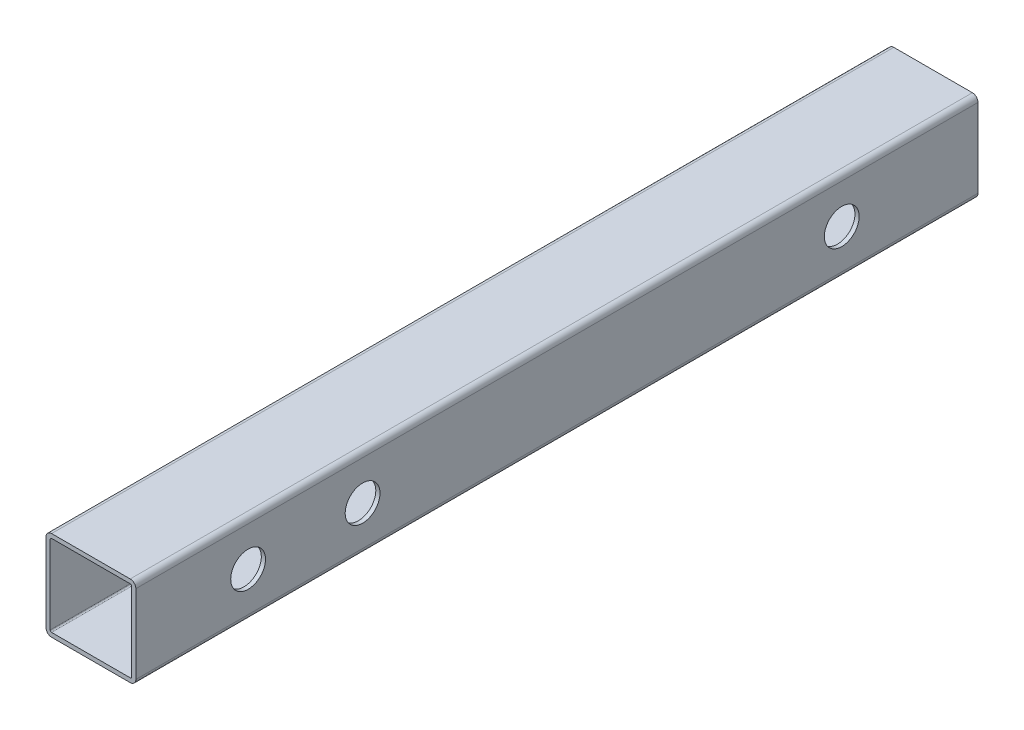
ISO-10303-21;
HEADER;
FILE_DESCRIPTION(('STEP AP214'),'2;1');
FILE_NAME('part.step','',(''),(''),'','','');
FILE_SCHEMA(('AUTOMOTIVE_DESIGN { 1 0 10303 214 1 1 1 1 }'));
ENDSEC;
DATA;
#1=APPLICATION_CONTEXT('core data for automotive mechanical design processes');
#2=APPLICATION_PROTOCOL_DEFINITION('international standard','automotive_design',2000,#1);
#3=PRODUCT_CONTEXT('',#1,'mechanical');
#4=PRODUCT('Part','Part','',(#3));
#5=PRODUCT_RELATED_PRODUCT_CATEGORY('part','',(#4));
#6=PRODUCT_DEFINITION_FORMATION('','',#4);
#7=PRODUCT_DEFINITION_CONTEXT('part definition',#1,'design');
#8=PRODUCT_DEFINITION('design','',#6,#7);
#9=PRODUCT_DEFINITION_SHAPE('','',#8);
#10=(LENGTH_UNIT() NAMED_UNIT(*) SI_UNIT(.MILLI.,.METRE.));
#11=(NAMED_UNIT(*) PLANE_ANGLE_UNIT() SI_UNIT($,.RADIAN.));
#12=(NAMED_UNIT(*) SI_UNIT($,.STERADIAN.) SOLID_ANGLE_UNIT());
#13=UNCERTAINTY_MEASURE_WITH_UNIT(LENGTH_MEASURE(1.E-05),#10,'distance_accuracy_value','');
#14=(GEOMETRIC_REPRESENTATION_CONTEXT(3) GLOBAL_UNCERTAINTY_ASSIGNED_CONTEXT((#13)) GLOBAL_UNIT_ASSIGNED_CONTEXT((#10,
#11,#12)) REPRESENTATION_CONTEXT('',''));
#15=CARTESIAN_POINT('',(0.,0.,0.));
#16=DIRECTION('',(0.,0.,1.));
#17=DIRECTION('',(1.,0.,0.));
#18=AXIS2_PLACEMENT_3D('',#15,#16,#17);
#19=CARTESIAN_POINT('',(-44.45,44.45,476.25));
#20=DIRECTION('',(0.,0.,-1.));
#21=DIRECTION('',(-1.,0.,0.));
#22=AXIS2_PLACEMENT_3D('',#19,#20,#21);
#23=PLANE('',#22);
#24=CARTESIAN_POINT('',(-44.45,44.45,476.25));
#25=DIRECTION('',(0.,0.,1.));
#26=DIRECTION('',(-1.,0.,0.));
#27=AXIS2_PLACEMENT_3D('',#24,#25,#26);
#28=CIRCLE('',#27,6.35);
#29=CARTESIAN_POINT('',(-44.45,50.8,476.25));
#30=VERTEX_POINT('',#29);
#31=CARTESIAN_POINT('',(-50.8,44.45,476.25));
#32=VERTEX_POINT('',#31);
#33=EDGE_CURVE('E227',#30,#32,#28,.T.);
#34=ORIENTED_EDGE('',*,*,#33,.T.);
#35=DIRECTION('',(0.,-1.,0.));
#36=VECTOR('',#35,1.);
#37=CARTESIAN_POINT('',(-50.8,44.45,476.25));
#38=LINE('',#37,#36);
#39=CARTESIAN_POINT('',(-50.8,-44.45,476.25));
#40=VERTEX_POINT('',#39);
#41=EDGE_CURVE('E230',#32,#40,#38,.T.);
#42=ORIENTED_EDGE('',*,*,#41,.T.);
#43=CARTESIAN_POINT('',(-44.45,-44.45,476.25));
#44=DIRECTION('',(0.,0.,1.));
#45=DIRECTION('',(-1.,0.,0.));
#46=AXIS2_PLACEMENT_3D('',#43,#44,#45);
#47=CIRCLE('',#46,6.35);
#48=CARTESIAN_POINT('',(-44.4499999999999,-50.8,476.25));
#49=VERTEX_POINT('',#48);
#50=EDGE_CURVE('E233',#40,#49,#47,.T.);
#51=ORIENTED_EDGE('',*,*,#50,.T.);
#52=DIRECTION('',(1.,0.,0.));
#53=VECTOR('',#52,1.);
#54=CARTESIAN_POINT('',(-44.4499999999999,-50.8,476.25));
#55=LINE('',#54,#53);
#56=CARTESIAN_POINT('',(44.45,-50.8,476.25));
#57=VERTEX_POINT('',#56);
#58=EDGE_CURVE('E235',#49,#57,#55,.T.);
#59=ORIENTED_EDGE('',*,*,#58,.T.);
#60=CARTESIAN_POINT('',(44.45,-44.45,476.25));
#61=DIRECTION('',(0.,0.,1.));
#62=DIRECTION('',(1.,0.,0.));
#63=AXIS2_PLACEMENT_3D('',#60,#61,#62);
#64=CIRCLE('',#63,6.35);
#65=CARTESIAN_POINT('',(50.8,-44.45,476.25));
#66=VERTEX_POINT('',#65);
#67=EDGE_CURVE('E237',#57,#66,#64,.T.);
#68=ORIENTED_EDGE('',*,*,#67,.T.);
#69=DIRECTION('',(0.,1.,0.));
#70=VECTOR('',#69,1.);
#71=CARTESIAN_POINT('',(50.8,44.45,476.25));
#72=LINE('',#71,#70);
#73=CARTESIAN_POINT('',(50.8,44.45,476.25));
#74=VERTEX_POINT('',#73);
#75=EDGE_CURVE('E239',#66,#74,#72,.T.);
#76=ORIENTED_EDGE('',*,*,#75,.T.);
#77=CARTESIAN_POINT('',(44.45,44.45,476.25));
#78=DIRECTION('',(0.,0.,1.));
#79=DIRECTION('',(1.,0.,0.));
#80=AXIS2_PLACEMENT_3D('',#77,#78,#79);
#81=CIRCLE('',#80,6.35);
#82=CARTESIAN_POINT('',(44.4499999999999,50.8,476.25));
#83=VERTEX_POINT('',#82);
#84=EDGE_CURVE('E241',#74,#83,#81,.T.);
#85=ORIENTED_EDGE('',*,*,#84,.T.);
#86=DIRECTION('',(-1.,0.,0.));
#87=VECTOR('',#86,1.);
#88=CARTESIAN_POINT('',(-44.45,50.8,476.25));
#89=LINE('',#88,#87);
#90=EDGE_CURVE('E243',#83,#30,#89,.T.);
#91=ORIENTED_EDGE('',*,*,#90,.T.);
#92=EDGE_LOOP('',(#34,#42,#51,#59,#68,#76,#85,#91));
#93=FACE_BOUND('',#92,.T.);
#94=CARTESIAN_POINT('',(-44.45,44.45,476.25));
#95=DIRECTION('',(0.,0.,1.));
#96=DIRECTION('',(-1.,0.,0.));
#97=AXIS2_PLACEMENT_3D('',#94,#95,#96);
#98=CIRCLE('',#97,1.5875);
#99=CARTESIAN_POINT('',(-44.45,46.0375,476.25));
#100=VERTEX_POINT('',#99);
#101=CARTESIAN_POINT('',(-46.0375,44.45,476.25));
#102=VERTEX_POINT('',#101);
#103=EDGE_CURVE('E154',#100,#102,#98,.T.);
#104=ORIENTED_EDGE('',*,*,#103,.F.);
#105=DIRECTION('',(-1.,0.,0.));
#106=VECTOR('',#105,1.);
#107=CARTESIAN_POINT('',(-44.45,46.0375,476.25));
#108=LINE('',#107,#106);
#109=CARTESIAN_POINT('',(44.4499999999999,46.0375,476.25));
#110=VERTEX_POINT('',#109);
#111=EDGE_CURVE('E189',#110,#100,#108,.T.);
#112=ORIENTED_EDGE('',*,*,#111,.F.);
#113=CARTESIAN_POINT('',(44.45,44.45,476.25));
#114=DIRECTION('',(0.,0.,1.));
#115=DIRECTION('',(1.,0.,0.));
#116=AXIS2_PLACEMENT_3D('',#113,#114,#115);
#117=CIRCLE('',#116,1.5875);
#118=CARTESIAN_POINT('',(46.0375,44.45,476.25));
#119=VERTEX_POINT('',#118);
#120=EDGE_CURVE('E187',#119,#110,#117,.T.);
#121=ORIENTED_EDGE('',*,*,#120,.F.);
#122=DIRECTION('',(0.,1.,0.));
#123=VECTOR('',#122,1.);
#124=CARTESIAN_POINT('',(46.0375,44.45,476.25));
#125=LINE('',#124,#123);
#126=CARTESIAN_POINT('',(46.0375,-44.45,476.25));
#127=VERTEX_POINT('',#126);
#128=EDGE_CURVE('E185',#127,#119,#125,.T.);
#129=ORIENTED_EDGE('',*,*,#128,.F.);
#130=CARTESIAN_POINT('',(44.45,-44.45,476.25));
#131=DIRECTION('',(0.,0.,1.));
#132=DIRECTION('',(1.,0.,0.));
#133=AXIS2_PLACEMENT_3D('',#130,#131,#132);
#134=CIRCLE('',#133,1.58749999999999);
#135=CARTESIAN_POINT('',(44.45,-46.0375,476.25));
#136=VERTEX_POINT('',#135);
#137=EDGE_CURVE('E183',#136,#127,#134,.T.);
#138=ORIENTED_EDGE('',*,*,#137,.F.);
#139=DIRECTION('',(1.,0.,0.));
#140=VECTOR('',#139,1.);
#141=CARTESIAN_POINT('',(-44.4499999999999,-46.0375,476.25));
#142=LINE('',#141,#140);
#143=CARTESIAN_POINT('',(-44.4499999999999,-46.0375,476.25));
#144=VERTEX_POINT('',#143);
#145=EDGE_CURVE('E178',#144,#136,#142,.T.);
#146=ORIENTED_EDGE('',*,*,#145,.F.);
#147=CARTESIAN_POINT('',(-44.45,-44.45,476.25));
#148=DIRECTION('',(0.,0.,1.));
#149=DIRECTION('',(-1.,0.,0.));
#150=AXIS2_PLACEMENT_3D('',#147,#148,#149);
#151=CIRCLE('',#150,1.5875);
#152=CARTESIAN_POINT('',(-46.0375,-44.45,476.25));
#153=VERTEX_POINT('',#152);
#154=EDGE_CURVE('E176',#153,#144,#151,.T.);
#155=ORIENTED_EDGE('',*,*,#154,.F.);
#156=DIRECTION('',(0.,-1.,0.));
#157=VECTOR('',#156,1.);
#158=CARTESIAN_POINT('',(-46.0375,44.45,476.25));
#159=LINE('',#158,#157);
#160=EDGE_CURVE('E162',#102,#153,#159,.T.);
#161=ORIENTED_EDGE('',*,*,#160,.F.);
#162=EDGE_LOOP('',(#104,#112,#121,#129,#138,#146,#155,#161));
#163=FACE_BOUND('',#162,.T.);
#164=ADVANCED_FACE('F38',(#93,#163),#23,.F.);
#165=CARTESIAN_POINT('',(-44.45,44.45,-476.25));
#166=DIRECTION('',(0.,0.,-1.));
#167=DIRECTION('',(-1.,0.,0.));
#168=AXIS2_PLACEMENT_3D('',#165,#166,#167);
#169=PLANE('',#168);
#170=CARTESIAN_POINT('',(-44.45,44.45,-476.25));
#171=DIRECTION('',(0.,0.,1.));
#172=DIRECTION('',(-1.,0.,0.));
#173=AXIS2_PLACEMENT_3D('',#170,#171,#172);
#174=CIRCLE('',#173,6.35);
#175=CARTESIAN_POINT('',(-44.45,50.8,-476.25));
#176=VERTEX_POINT('',#175);
#177=CARTESIAN_POINT('',(-50.8,44.45,-476.25));
#178=VERTEX_POINT('',#177);
#179=EDGE_CURVE('E171',#176,#178,#174,.T.);
#180=ORIENTED_EDGE('',*,*,#179,.F.);
#181=DIRECTION('',(-1.,0.,0.));
#182=VECTOR('',#181,1.);
#183=CARTESIAN_POINT('',(-44.45,50.8,-476.25));
#184=LINE('',#183,#182);
#185=CARTESIAN_POINT('',(44.4499999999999,50.8,-476.25));
#186=VERTEX_POINT('',#185);
#187=EDGE_CURVE('E231',#186,#176,#184,.T.);
#188=ORIENTED_EDGE('',*,*,#187,.F.);
#189=CARTESIAN_POINT('',(44.45,44.45,-476.25));
#190=DIRECTION('',(0.,0.,1.));
#191=DIRECTION('',(1.,0.,0.));
#192=AXIS2_PLACEMENT_3D('',#189,#190,#191);
#193=CIRCLE('',#192,6.35);
#194=CARTESIAN_POINT('',(50.8,44.45,-476.25));
#195=VERTEX_POINT('',#194);
#196=EDGE_CURVE('E258',#195,#186,#193,.T.);
#197=ORIENTED_EDGE('',*,*,#196,.F.);
#198=DIRECTION('',(0.,1.,0.));
#199=VECTOR('',#198,1.);
#200=CARTESIAN_POINT('',(50.8,44.45,-476.25));
#201=LINE('',#200,#199);
#202=CARTESIAN_POINT('',(50.8,-44.45,-476.25));
#203=VERTEX_POINT('',#202);
#204=EDGE_CURVE('E256',#203,#195,#201,.T.);
#205=ORIENTED_EDGE('',*,*,#204,.F.);
#206=CARTESIAN_POINT('',(44.45,-44.45,-476.25));
#207=DIRECTION('',(0.,0.,1.));
#208=DIRECTION('',(1.,0.,0.));
#209=AXIS2_PLACEMENT_3D('',#206,#207,#208);
#210=CIRCLE('',#209,6.35);
#211=CARTESIAN_POINT('',(44.45,-50.8,-476.25));
#212=VERTEX_POINT('',#211);
#213=EDGE_CURVE('E254',#212,#203,#210,.T.);
#214=ORIENTED_EDGE('',*,*,#213,.F.);
#215=DIRECTION('',(1.,0.,0.));
#216=VECTOR('',#215,1.);
#217=CARTESIAN_POINT('',(-44.4499999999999,-50.8,-476.25));
#218=LINE('',#217,#216);
#219=CARTESIAN_POINT('',(-44.4499999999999,-50.8,-476.25));
#220=VERTEX_POINT('',#219);
#221=EDGE_CURVE('E252',#220,#212,#218,.T.);
#222=ORIENTED_EDGE('',*,*,#221,.F.);
#223=CARTESIAN_POINT('',(-44.45,-44.45,-476.25));
#224=DIRECTION('',(0.,0.,1.));
#225=DIRECTION('',(-1.,0.,0.));
#226=AXIS2_PLACEMENT_3D('',#223,#224,#225);
#227=CIRCLE('',#226,6.35);
#228=CARTESIAN_POINT('',(-50.8,-44.45,-476.25));
#229=VERTEX_POINT('',#228);
#230=EDGE_CURVE('E250',#229,#220,#227,.T.);
#231=ORIENTED_EDGE('',*,*,#230,.F.);
#232=DIRECTION('',(0.,-1.,0.));
#233=VECTOR('',#232,1.);
#234=CARTESIAN_POINT('',(-50.8,44.45,-476.25));
#235=LINE('',#234,#233);
#236=EDGE_CURVE('E248',#178,#229,#235,.T.);
#237=ORIENTED_EDGE('',*,*,#236,.F.);
#238=EDGE_LOOP('',(#180,#188,#197,#205,#214,#222,#231,#237));
#239=FACE_BOUND('',#238,.T.);
#240=DIRECTION('',(-1.,0.,0.));
#241=VECTOR('',#240,1.);
#242=CARTESIAN_POINT('',(-44.45,46.0375,-476.25));
#243=LINE('',#242,#241);
#244=CARTESIAN_POINT('',(44.4499999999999,46.0375,-476.25));
#245=VERTEX_POINT('',#244);
#246=CARTESIAN_POINT('',(-44.45,46.0375,-476.25));
#247=VERTEX_POINT('',#246);
#248=EDGE_CURVE('E163',#245,#247,#243,.T.);
#249=ORIENTED_EDGE('',*,*,#248,.T.);
#250=CARTESIAN_POINT('',(-44.45,44.45,-476.25));
#251=DIRECTION('',(0.,0.,1.));
#252=DIRECTION('',(-1.,0.,0.));
#253=AXIS2_PLACEMENT_3D('',#250,#251,#252);
#254=CIRCLE('',#253,1.5875);
#255=CARTESIAN_POINT('',(-46.0375,44.45,-476.25));
#256=VERTEX_POINT('',#255);
#257=EDGE_CURVE('E64',#247,#256,#254,.T.);
#258=ORIENTED_EDGE('',*,*,#257,.T.);
#259=DIRECTION('',(0.,-1.,0.));
#260=VECTOR('',#259,1.);
#261=CARTESIAN_POINT('',(-46.0375,44.45,-476.25));
#262=LINE('',#261,#260);
#263=CARTESIAN_POINT('',(-46.0375,-44.45,-476.25));
#264=VERTEX_POINT('',#263);
#265=EDGE_CURVE('E169',#256,#264,#262,.T.);
#266=ORIENTED_EDGE('',*,*,#265,.T.);
#267=CARTESIAN_POINT('',(-44.45,-44.45,-476.25));
#268=DIRECTION('',(0.,0.,1.));
#269=DIRECTION('',(-1.,0.,0.));
#270=AXIS2_PLACEMENT_3D('',#267,#268,#269);
#271=CIRCLE('',#270,1.5875);
#272=CARTESIAN_POINT('',(-44.4499999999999,-46.0375,-476.25));
#273=VERTEX_POINT('',#272);
#274=EDGE_CURVE('E194',#264,#273,#271,.T.);
#275=ORIENTED_EDGE('',*,*,#274,.T.);
#276=DIRECTION('',(1.,0.,0.));
#277=VECTOR('',#276,1.);
#278=CARTESIAN_POINT('',(-44.4499999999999,-46.0375,-476.25));
#279=LINE('',#278,#277);
#280=CARTESIAN_POINT('',(44.45,-46.0375,-476.25));
#281=VERTEX_POINT('',#280);
#282=EDGE_CURVE('E197',#273,#281,#279,.T.);
#283=ORIENTED_EDGE('',*,*,#282,.T.);
#284=CARTESIAN_POINT('',(44.45,-44.45,-476.25));
#285=DIRECTION('',(0.,0.,1.));
#286=DIRECTION('',(1.,0.,0.));
#287=AXIS2_PLACEMENT_3D('',#284,#285,#286);
#288=CIRCLE('',#287,1.58749999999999);
#289=CARTESIAN_POINT('',(46.0375,-44.45,-476.25));
#290=VERTEX_POINT('',#289);
#291=EDGE_CURVE('E200',#281,#290,#288,.T.);
#292=ORIENTED_EDGE('',*,*,#291,.T.);
#293=DIRECTION('',(0.,1.,0.));
#294=VECTOR('',#293,1.);
#295=CARTESIAN_POINT('',(46.0375,44.45,-476.25));
#296=LINE('',#295,#294);
#297=CARTESIAN_POINT('',(46.0375,44.45,-476.25));
#298=VERTEX_POINT('',#297);
#299=EDGE_CURVE('E203',#290,#298,#296,.T.);
#300=ORIENTED_EDGE('',*,*,#299,.T.);
#301=CARTESIAN_POINT('',(44.45,44.45,-476.25));
#302=DIRECTION('',(0.,0.,1.));
#303=DIRECTION('',(1.,0.,0.));
#304=AXIS2_PLACEMENT_3D('',#301,#302,#303);
#305=CIRCLE('',#304,1.5875);
#306=EDGE_CURVE('E206',#298,#245,#305,.T.);
#307=ORIENTED_EDGE('',*,*,#306,.T.);
#308=EDGE_LOOP('',(#249,#258,#266,#275,#283,#292,#300,#307));
#309=FACE_BOUND('',#308,.T.);
#310=ADVANCED_FACE('F335',(#239,#309),#169,.T.);
#311=CARTESIAN_POINT('',(-44.45,44.45,476.25));
#312=DIRECTION('',(0.,0.,-1.));
#313=DIRECTION('',(-1.,0.,0.));
#314=AXIS2_PLACEMENT_3D('',#311,#312,#313);
#315=CYLINDRICAL_SURFACE('',#314,6.35);
#316=ORIENTED_EDGE('',*,*,#179,.T.);
#317=DIRECTION('',(0.,0.,-1.));
#318=VECTOR('',#317,1.);
#319=CARTESIAN_POINT('',(-50.8,44.45,476.25));
#320=LINE('',#319,#318);
#321=EDGE_CURVE('E11',#32,#178,#320,.T.);
#322=ORIENTED_EDGE('',*,*,#321,.F.);
#323=ORIENTED_EDGE('',*,*,#33,.F.);
#324=DIRECTION('',(0.,0.,-1.));
#325=VECTOR('',#324,1.);
#326=CARTESIAN_POINT('',(-44.45,50.8,476.25));
#327=LINE('',#326,#325);
#328=EDGE_CURVE('E245',#30,#176,#327,.T.);
#329=ORIENTED_EDGE('',*,*,#328,.T.);
#330=EDGE_LOOP('',(#316,#322,#323,#329));
#331=FACE_BOUND('',#330,.T.);
#332=ADVANCED_FACE('F40',(#331),#315,.T.);
#333=CARTESIAN_POINT('',(-50.8,44.45,476.25));
#334=DIRECTION('',(1.,0.,0.));
#335=DIRECTION('',(0.,1.,0.));
#336=AXIS2_PLACEMENT_3D('',#333,#334,#335);
#337=PLANE('',#336);
#338=CARTESIAN_POINT('',(-50.8,0.,349.25));
#339=DIRECTION('',(-1.,0.,0.));
#340=DIRECTION('',(0.,-1.,0.));
#341=AXIS2_PLACEMENT_3D('',#338,#339,#340);
#342=CIRCLE('',#341,19.685);
#343=CARTESIAN_POINT('',(-50.8,-19.685,349.25));
#344=VERTEX_POINT('',#343);
#345=EDGE_CURVE('E376',#344,#344,#342,.T.);
#346=ORIENTED_EDGE('',*,*,#345,.F.);
#347=EDGE_LOOP('',(#346));
#348=FACE_BOUND('',#347,.T.);
#349=CARTESIAN_POINT('',(-50.8,0.,219.77604));
#350=DIRECTION('',(-1.,0.,0.));
#351=DIRECTION('',(0.,-1.,0.));
#352=AXIS2_PLACEMENT_3D('',#349,#350,#351);
#353=CIRCLE('',#352,19.685);
#354=CARTESIAN_POINT('',(-50.8,-19.685,219.77604));
#355=VERTEX_POINT('',#354);
#356=EDGE_CURVE('E300',#355,#355,#353,.T.);
#357=ORIENTED_EDGE('',*,*,#356,.F.);
#358=EDGE_LOOP('',(#357));
#359=FACE_BOUND('',#358,.T.);
#360=CARTESIAN_POINT('',(-50.8,0.,-322.13804));
#361=DIRECTION('',(-1.,0.,0.));
#362=DIRECTION('',(0.,-1.,0.));
#363=AXIS2_PLACEMENT_3D('',#360,#361,#362);
#364=CIRCLE('',#363,19.685);
#365=CARTESIAN_POINT('',(-50.8,-19.685,-322.13804));
#366=VERTEX_POINT('',#365);
#367=EDGE_CURVE('E297',#366,#366,#364,.T.);
#368=ORIENTED_EDGE('',*,*,#367,.F.);
#369=EDGE_LOOP('',(#368));
#370=FACE_BOUND('',#369,.T.);
#371=ORIENTED_EDGE('',*,*,#236,.T.);
#372=DIRECTION('',(0.,0.,-1.));
#373=VECTOR('',#372,1.);
#374=CARTESIAN_POINT('',(-50.8,-44.45,476.25));
#375=LINE('',#374,#373);
#376=EDGE_CURVE('E48',#40,#229,#375,.T.);
#377=ORIENTED_EDGE('',*,*,#376,.F.);
#378=ORIENTED_EDGE('',*,*,#41,.F.);
#379=ORIENTED_EDGE('',*,*,#321,.T.);
#380=EDGE_LOOP('',(#371,#377,#378,#379));
#381=FACE_BOUND('',#380,.T.);
#382=ADVANCED_FACE('F365',(#348,#359,#370,#381),#337,.F.);
#383=CARTESIAN_POINT('',(-44.45,-44.45,476.25));
#384=DIRECTION('',(0.,0.,-1.));
#385=DIRECTION('',(-1.,0.,0.));
#386=AXIS2_PLACEMENT_3D('',#383,#384,#385);
#387=CYLINDRICAL_SURFACE('',#386,6.35);
#388=ORIENTED_EDGE('',*,*,#230,.T.);
#389=DIRECTION('',(0.,0.,-1.));
#390=VECTOR('',#389,1.);
#391=CARTESIAN_POINT('',(-44.4499999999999,-50.8,476.25));
#392=LINE('',#391,#390);
#393=EDGE_CURVE('E280',#49,#220,#392,.T.);
#394=ORIENTED_EDGE('',*,*,#393,.F.);
#395=ORIENTED_EDGE('',*,*,#50,.F.);
#396=ORIENTED_EDGE('',*,*,#376,.T.);
#397=EDGE_LOOP('',(#388,#394,#395,#396));
#398=FACE_BOUND('',#397,.T.);
#399=ADVANCED_FACE('F362',(#398),#387,.T.);
#400=CARTESIAN_POINT('',(-44.4499999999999,-50.8,476.25));
#401=DIRECTION('',(0.,1.,0.));
#402=DIRECTION('',(0.,0.,1.));
#403=AXIS2_PLACEMENT_3D('',#400,#401,#402);
#404=PLANE('',#403);
#405=ORIENTED_EDGE('',*,*,#221,.T.);
#406=DIRECTION('',(0.,0.,-1.));
#407=VECTOR('',#406,1.);
#408=CARTESIAN_POINT('',(44.45,-50.8,476.25));
#409=LINE('',#408,#407);
#410=EDGE_CURVE('E276',#57,#212,#409,.T.);
#411=ORIENTED_EDGE('',*,*,#410,.F.);
#412=ORIENTED_EDGE('',*,*,#58,.F.);
#413=ORIENTED_EDGE('',*,*,#393,.T.);
#414=EDGE_LOOP('',(#405,#411,#412,#413));
#415=FACE_BOUND('',#414,.T.);
#416=ADVANCED_FACE('F358',(#415),#404,.F.);
#417=CARTESIAN_POINT('',(44.45,-44.45,476.25));
#418=DIRECTION('',(0.,0.,-1.));
#419=DIRECTION('',(-1.,0.,0.));
#420=AXIS2_PLACEMENT_3D('',#417,#418,#419);
#421=CYLINDRICAL_SURFACE('',#420,6.35);
#422=ORIENTED_EDGE('',*,*,#213,.T.);
#423=DIRECTION('',(0.,0.,-1.));
#424=VECTOR('',#423,1.);
#425=CARTESIAN_POINT('',(50.8,-44.45,476.25));
#426=LINE('',#425,#424);
#427=EDGE_CURVE('E272',#66,#203,#426,.T.);
#428=ORIENTED_EDGE('',*,*,#427,.F.);
#429=ORIENTED_EDGE('',*,*,#67,.F.);
#430=ORIENTED_EDGE('',*,*,#410,.T.);
#431=EDGE_LOOP('',(#422,#428,#429,#430));
#432=FACE_BOUND('',#431,.T.);
#433=ADVANCED_FACE('F354',(#432),#421,.T.);
#434=CARTESIAN_POINT('',(50.8,44.45,476.25));
#435=DIRECTION('',(-1.,0.,0.));
#436=DIRECTION('',(0.,-1.,0.));
#437=AXIS2_PLACEMENT_3D('',#434,#435,#436);
#438=PLANE('',#437);
#439=CARTESIAN_POINT('',(50.8,0.,349.25));
#440=DIRECTION('',(-1.,0.,0.));
#441=DIRECTION('',(0.,-1.,0.));
#442=AXIS2_PLACEMENT_3D('',#439,#440,#441);
#443=CIRCLE('',#442,19.685);
#444=CARTESIAN_POINT('',(50.8,-19.685,349.25));
#445=VERTEX_POINT('',#444);
#446=EDGE_CURVE('E462',#445,#445,#443,.T.);
#447=ORIENTED_EDGE('',*,*,#446,.T.);
#448=EDGE_LOOP('',(#447));
#449=FACE_BOUND('',#448,.T.);
#450=CARTESIAN_POINT('',(50.8,0.,219.77604));
#451=DIRECTION('',(-1.,0.,0.));
#452=DIRECTION('',(0.,-1.,0.));
#453=AXIS2_PLACEMENT_3D('',#450,#451,#452);
#454=CIRCLE('',#453,19.685);
#455=CARTESIAN_POINT('',(50.8,-19.685,219.77604));
#456=VERTEX_POINT('',#455);
#457=EDGE_CURVE('E292',#456,#456,#454,.T.);
#458=ORIENTED_EDGE('',*,*,#457,.T.);
#459=EDGE_LOOP('',(#458));
#460=FACE_BOUND('',#459,.T.);
#461=CARTESIAN_POINT('',(50.8,0.,-322.13804));
#462=DIRECTION('',(-1.,0.,0.));
#463=DIRECTION('',(0.,-1.,0.));
#464=AXIS2_PLACEMENT_3D('',#461,#462,#463);
#465=CIRCLE('',#464,19.685);
#466=CARTESIAN_POINT('',(50.8,-19.685,-322.13804));
#467=VERTEX_POINT('',#466);
#468=EDGE_CURVE('E287',#467,#467,#465,.T.);
#469=ORIENTED_EDGE('',*,*,#468,.T.);
#470=EDGE_LOOP('',(#469));
#471=FACE_BOUND('',#470,.T.);
#472=ORIENTED_EDGE('',*,*,#204,.T.);
#473=DIRECTION('',(0.,0.,-1.));
#474=VECTOR('',#473,1.);
#475=CARTESIAN_POINT('',(50.8,44.45,476.25));
#476=LINE('',#475,#474);
#477=EDGE_CURVE('E268',#74,#195,#476,.T.);
#478=ORIENTED_EDGE('',*,*,#477,.F.);
#479=ORIENTED_EDGE('',*,*,#75,.F.);
#480=ORIENTED_EDGE('',*,*,#427,.T.);
#481=EDGE_LOOP('',(#472,#478,#479,#480));
#482=FACE_BOUND('',#481,.T.);
#483=ADVANCED_FACE('F350',(#449,#460,#471,#482),#438,.F.);
#484=CARTESIAN_POINT('',(44.45,44.45,476.25));
#485=DIRECTION('',(0.,0.,-1.));
#486=DIRECTION('',(-1.,0.,0.));
#487=AXIS2_PLACEMENT_3D('',#484,#485,#486);
#488=CYLINDRICAL_SURFACE('',#487,6.35);
#489=ORIENTED_EDGE('',*,*,#196,.T.);
#490=DIRECTION('',(0.,0.,-1.));
#491=VECTOR('',#490,1.);
#492=CARTESIAN_POINT('',(44.4499999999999,50.8,476.25));
#493=LINE('',#492,#491);
#494=EDGE_CURVE('E264',#83,#186,#493,.T.);
#495=ORIENTED_EDGE('',*,*,#494,.F.);
#496=ORIENTED_EDGE('',*,*,#84,.F.);
#497=ORIENTED_EDGE('',*,*,#477,.T.);
#498=EDGE_LOOP('',(#489,#495,#496,#497));
#499=FACE_BOUND('',#498,.T.);
#500=ADVANCED_FACE('F346',(#499),#488,.T.);
#501=CARTESIAN_POINT('',(-44.45,50.8,476.25));
#502=DIRECTION('',(0.,-1.,0.));
#503=DIRECTION('',(0.,0.,-1.));
#504=AXIS2_PLACEMENT_3D('',#501,#502,#503);
#505=PLANE('',#504);
#506=ORIENTED_EDGE('',*,*,#187,.T.);
#507=ORIENTED_EDGE('',*,*,#328,.F.);
#508=ORIENTED_EDGE('',*,*,#90,.F.);
#509=ORIENTED_EDGE('',*,*,#494,.T.);
#510=EDGE_LOOP('',(#506,#507,#508,#509));
#511=FACE_BOUND('',#510,.T.);
#512=ADVANCED_FACE('F330',(#511),#505,.F.);
#513=CARTESIAN_POINT('',(-44.45,44.45,476.25));
#514=DIRECTION('',(0.,0.,-1.));
#515=DIRECTION('',(-1.,0.,0.));
#516=AXIS2_PLACEMENT_3D('',#513,#514,#515);
#517=CYLINDRICAL_SURFACE('',#516,1.5875);
#518=ORIENTED_EDGE('',*,*,#257,.F.);
#519=DIRECTION('',(0.,0.,-1.));
#520=VECTOR('',#519,1.);
#521=CARTESIAN_POINT('',(-44.45,46.0375,476.25));
#522=LINE('',#521,#520);
#523=EDGE_CURVE('E158',#100,#247,#522,.T.);
#524=ORIENTED_EDGE('',*,*,#523,.F.);
#525=ORIENTED_EDGE('',*,*,#103,.T.);
#526=DIRECTION('',(0.,0.,-1.));
#527=VECTOR('',#526,1.);
#528=CARTESIAN_POINT('',(-46.0375,44.45,476.25));
#529=LINE('',#528,#527);
#530=EDGE_CURVE('E157',#102,#256,#529,.T.);
#531=ORIENTED_EDGE('',*,*,#530,.T.);
#532=EDGE_LOOP('',(#518,#524,#525,#531));
#533=FACE_BOUND('',#532,.T.);
#534=ADVANCED_FACE('F156',(#533),#517,.F.);
#535=CARTESIAN_POINT('',(-46.0375,44.45,476.25));
#536=DIRECTION('',(1.,0.,0.));
#537=DIRECTION('',(0.,1.,0.));
#538=AXIS2_PLACEMENT_3D('',#535,#536,#537);
#539=PLANE('',#538);
#540=CARTESIAN_POINT('',(-46.0375,0.,349.25));
#541=DIRECTION('',(1.,0.,0.));
#542=DIRECTION('',(0.,1.,0.));
#543=AXIS2_PLACEMENT_3D('',#540,#541,#542);
#544=CIRCLE('',#543,19.685);
#545=CARTESIAN_POINT('',(-46.0375,-19.685,349.25));
#546=VERTEX_POINT('',#545);
#547=EDGE_CURVE('E305',#546,#546,#544,.T.);
#548=ORIENTED_EDGE('',*,*,#547,.F.);
#549=EDGE_LOOP('',(#548));
#550=FACE_BOUND('',#549,.T.);
#551=CARTESIAN_POINT('',(-46.0375,0.,219.77604));
#552=DIRECTION('',(1.,0.,0.));
#553=DIRECTION('',(0.,1.,0.));
#554=AXIS2_PLACEMENT_3D('',#551,#552,#553);
#555=CIRCLE('',#554,19.685);
#556=CARTESIAN_POINT('',(-46.0375,-19.685,219.77604));
#557=VERTEX_POINT('',#556);
#558=EDGE_CURVE('E291',#557,#557,#555,.T.);
#559=ORIENTED_EDGE('',*,*,#558,.F.);
#560=EDGE_LOOP('',(#559));
#561=FACE_BOUND('',#560,.T.);
#562=CARTESIAN_POINT('',(-46.0375,0.,-322.13804));
#563=DIRECTION('',(1.,0.,0.));
#564=DIRECTION('',(0.,1.,0.));
#565=AXIS2_PLACEMENT_3D('',#562,#563,#564);
#566=CIRCLE('',#565,19.685);
#567=CARTESIAN_POINT('',(-46.0375,-19.685,-322.13804));
#568=VERTEX_POINT('',#567);
#569=EDGE_CURVE('E192',#568,#568,#566,.T.);
#570=ORIENTED_EDGE('',*,*,#569,.F.);
#571=EDGE_LOOP('',(#570));
#572=FACE_BOUND('',#571,.T.);
#573=ORIENTED_EDGE('',*,*,#265,.F.);
#574=ORIENTED_EDGE('',*,*,#530,.F.);
#575=ORIENTED_EDGE('',*,*,#160,.T.);
#576=DIRECTION('',(0.,0.,-1.));
#577=VECTOR('',#576,1.);
#578=CARTESIAN_POINT('',(-46.0375,-44.45,476.25));
#579=LINE('',#578,#577);
#580=EDGE_CURVE('E172',#153,#264,#579,.T.);
#581=ORIENTED_EDGE('',*,*,#580,.T.);
#582=EDGE_LOOP('',(#573,#574,#575,#581));
#583=FACE_BOUND('',#582,.T.);
#584=ADVANCED_FACE('F166',(#550,#561,#572,#583),#539,.T.);
#585=CARTESIAN_POINT('',(-44.45,-44.45,476.25));
#586=DIRECTION('',(0.,0.,-1.));
#587=DIRECTION('',(-1.,0.,0.));
#588=AXIS2_PLACEMENT_3D('',#585,#586,#587);
#589=CYLINDRICAL_SURFACE('',#588,1.5875);
#590=ORIENTED_EDGE('',*,*,#274,.F.);
#591=ORIENTED_EDGE('',*,*,#580,.F.);
#592=ORIENTED_EDGE('',*,*,#154,.T.);
#593=DIRECTION('',(0.,0.,-1.));
#594=VECTOR('',#593,1.);
#595=CARTESIAN_POINT('',(-44.4499999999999,-46.0375,476.25));
#596=LINE('',#595,#594);
#597=EDGE_CURVE('E224',#144,#273,#596,.T.);
#598=ORIENTED_EDGE('',*,*,#597,.T.);
#599=EDGE_LOOP('',(#590,#591,#592,#598));
#600=FACE_BOUND('',#599,.T.);
#601=ADVANCED_FACE('F320',(#600),#589,.F.);
#602=CARTESIAN_POINT('',(-44.4499999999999,-46.0375,476.25));
#603=DIRECTION('',(0.,1.,0.));
#604=DIRECTION('',(0.,0.,1.));
#605=AXIS2_PLACEMENT_3D('',#602,#603,#604);
#606=PLANE('',#605);
#607=ORIENTED_EDGE('',*,*,#282,.F.);
#608=ORIENTED_EDGE('',*,*,#597,.F.);
#609=ORIENTED_EDGE('',*,*,#145,.T.);
#610=DIRECTION('',(0.,0.,-1.));
#611=VECTOR('',#610,1.);
#612=CARTESIAN_POINT('',(44.45,-46.0375,476.25));
#613=LINE('',#612,#611);
#614=EDGE_CURVE('E221',#136,#281,#613,.T.);
#615=ORIENTED_EDGE('',*,*,#614,.T.);
#616=EDGE_LOOP('',(#607,#608,#609,#615));
#617=FACE_BOUND('',#616,.T.);
#618=ADVANCED_FACE('F327',(#617),#606,.T.);
#619=CARTESIAN_POINT('',(44.45,-44.45,476.25));
#620=DIRECTION('',(0.,0.,-1.));
#621=DIRECTION('',(-1.,0.,0.));
#622=AXIS2_PLACEMENT_3D('',#619,#620,#621);
#623=CYLINDRICAL_SURFACE('',#622,1.58749999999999);
#624=ORIENTED_EDGE('',*,*,#291,.F.);
#625=ORIENTED_EDGE('',*,*,#614,.F.);
#626=ORIENTED_EDGE('',*,*,#137,.T.);
#627=DIRECTION('',(0.,0.,-1.));
#628=VECTOR('',#627,1.);
#629=CARTESIAN_POINT('',(46.0375,-44.45,476.25));
#630=LINE('',#629,#628);
#631=EDGE_CURVE('E218',#127,#290,#630,.T.);
#632=ORIENTED_EDGE('',*,*,#631,.T.);
#633=EDGE_LOOP('',(#624,#625,#626,#632));
#634=FACE_BOUND('',#633,.T.);
#635=ADVANCED_FACE('F419',(#634),#623,.F.);
#636=CARTESIAN_POINT('',(46.0375,44.45,476.25));
#637=DIRECTION('',(-1.,0.,0.));
#638=DIRECTION('',(0.,0.,1.));
#639=AXIS2_PLACEMENT_3D('',#636,#637,#638);
#640=PLANE('',#639);
#641=CARTESIAN_POINT('',(46.0375,0.,349.25));
#642=DIRECTION('',(-1.,0.,0.));
#643=DIRECTION('',(0.,0.,1.));
#644=AXIS2_PLACEMENT_3D('',#641,#642,#643);
#645=CIRCLE('',#644,19.685);
#646=CARTESIAN_POINT('',(46.0375,-19.685,349.25));
#647=VERTEX_POINT('',#646);
#648=EDGE_CURVE('E42',#647,#647,#645,.T.);
#649=ORIENTED_EDGE('',*,*,#648,.F.);
#650=EDGE_LOOP('',(#649));
#651=FACE_BOUND('',#650,.T.);
#652=CARTESIAN_POINT('',(46.0375,0.,219.77604));
#653=DIRECTION('',(-1.,0.,0.));
#654=DIRECTION('',(0.,0.,1.));
#655=AXIS2_PLACEMENT_3D('',#652,#653,#654);
#656=CIRCLE('',#655,19.685);
#657=CARTESIAN_POINT('',(46.0375,-19.685,219.77604));
#658=VERTEX_POINT('',#657);
#659=EDGE_CURVE('E288',#658,#658,#656,.T.);
#660=ORIENTED_EDGE('',*,*,#659,.F.);
#661=EDGE_LOOP('',(#660));
#662=FACE_BOUND('',#661,.T.);
#663=CARTESIAN_POINT('',(46.0375,0.,-322.13804));
#664=DIRECTION('',(-1.,0.,0.));
#665=DIRECTION('',(0.,0.,1.));
#666=AXIS2_PLACEMENT_3D('',#663,#664,#665);
#667=CIRCLE('',#666,19.685);
#668=CARTESIAN_POINT('',(46.0375,-19.685,-322.13804));
#669=VERTEX_POINT('',#668);
#670=EDGE_CURVE('E285',#669,#669,#667,.T.);
#671=ORIENTED_EDGE('',*,*,#670,.F.);
#672=EDGE_LOOP('',(#671));
#673=FACE_BOUND('',#672,.T.);
#674=ORIENTED_EDGE('',*,*,#299,.F.);
#675=ORIENTED_EDGE('',*,*,#631,.F.);
#676=ORIENTED_EDGE('',*,*,#128,.T.);
#677=DIRECTION('',(0.,0.,-1.));
#678=VECTOR('',#677,1.);
#679=CARTESIAN_POINT('',(46.0375,44.45,476.25));
#680=LINE('',#679,#678);
#681=EDGE_CURVE('E215',#119,#298,#680,.T.);
#682=ORIENTED_EDGE('',*,*,#681,.T.);
#683=EDGE_LOOP('',(#674,#675,#676,#682));
#684=FACE_BOUND('',#683,.T.);
#685=ADVANCED_FACE('F415',(#651,#662,#673,#684),#640,.T.);
#686=CARTESIAN_POINT('',(44.45,44.45,476.25));
#687=DIRECTION('',(0.,0.,-1.));
#688=DIRECTION('',(-1.,0.,0.));
#689=AXIS2_PLACEMENT_3D('',#686,#687,#688);
#690=CYLINDRICAL_SURFACE('',#689,1.5875);
#691=ORIENTED_EDGE('',*,*,#306,.F.);
#692=ORIENTED_EDGE('',*,*,#681,.F.);
#693=ORIENTED_EDGE('',*,*,#120,.T.);
#694=DIRECTION('',(0.,0.,-1.));
#695=VECTOR('',#694,1.);
#696=CARTESIAN_POINT('',(44.4499999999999,46.0375,476.25));
#697=LINE('',#696,#695);
#698=EDGE_CURVE('E56',#110,#245,#697,.T.);
#699=ORIENTED_EDGE('',*,*,#698,.T.);
#700=EDGE_LOOP('',(#691,#692,#693,#699));
#701=FACE_BOUND('',#700,.T.);
#702=ADVANCED_FACE('F412',(#701),#690,.F.);
#703=CARTESIAN_POINT('',(-44.45,46.0375,476.25));
#704=DIRECTION('',(0.,-1.,0.));
#705=DIRECTION('',(0.,0.,-1.));
#706=AXIS2_PLACEMENT_3D('',#703,#704,#705);
#707=PLANE('',#706);
#708=ORIENTED_EDGE('',*,*,#248,.F.);
#709=ORIENTED_EDGE('',*,*,#698,.F.);
#710=ORIENTED_EDGE('',*,*,#111,.T.);
#711=ORIENTED_EDGE('',*,*,#523,.T.);
#712=EDGE_LOOP('',(#708,#709,#710,#711));
#713=FACE_BOUND('',#712,.T.);
#714=ADVANCED_FACE('F406',(#713),#707,.T.);
#715=CARTESIAN_POINT('',(50.8,0.,-322.13804));
#716=DIRECTION('',(-1.,0.,0.));
#717=DIRECTION('',(0.,-1.,0.));
#718=AXIS2_PLACEMENT_3D('',#715,#716,#717);
#719=CYLINDRICAL_SURFACE('',#718,19.685);
#720=CARTESIAN_POINT('',(46.0375,-19.685,-322.13804));
#721=CARTESIAN_POINT('',(46.087109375,-19.685,-322.13804));
#722=CARTESIAN_POINT('',(46.13671875,-19.685,-322.13804));
#723=CARTESIAN_POINT('',(46.2359375,-19.685,-322.13804));
#724=CARTESIAN_POINT('',(46.285546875,-19.685,-322.13804));
#725=CARTESIAN_POINT('',(46.384765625,-19.685,-322.13804));
#726=CARTESIAN_POINT('',(46.434375,-19.685,-322.13804));
#727=CARTESIAN_POINT('',(46.53359375,-19.685,-322.13804));
#728=CARTESIAN_POINT('',(46.583203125,-19.685,-322.13804));
#729=CARTESIAN_POINT('',(46.682421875,-19.685,-322.13804));
#730=CARTESIAN_POINT('',(46.73203125,-19.685,-322.13804));
#731=CARTESIAN_POINT('',(46.83125,-19.685,-322.13804));
#732=CARTESIAN_POINT('',(46.880859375,-19.685,-322.13804));
#733=CARTESIAN_POINT('',(46.980078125,-19.685,-322.13804));
#734=CARTESIAN_POINT('',(47.0296875,-19.685,-322.13804));
#735=CARTESIAN_POINT('',(47.12890625,-19.685,-322.13804));
#736=CARTESIAN_POINT('',(47.178515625,-19.685,-322.13804));
#737=CARTESIAN_POINT('',(47.277734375,-19.685,-322.13804));
#738=CARTESIAN_POINT('',(47.32734375,-19.685,-322.13804));
#739=CARTESIAN_POINT('',(47.4265625,-19.685,-322.13804));
#740=CARTESIAN_POINT('',(47.476171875,-19.685,-322.13804));
#741=CARTESIAN_POINT('',(47.575390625,-19.685,-322.13804));
#742=CARTESIAN_POINT('',(47.625,-19.685,-322.13804));
#743=CARTESIAN_POINT('',(47.72421875,-19.685,-322.13804));
#744=CARTESIAN_POINT('',(47.773828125,-19.685,-322.13804));
#745=CARTESIAN_POINT('',(47.873046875,-19.685,-322.13804));
#746=CARTESIAN_POINT('',(47.92265625,-19.685,-322.13804));
#747=CARTESIAN_POINT('',(48.021875,-19.685,-322.13804));
#748=CARTESIAN_POINT('',(48.071484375,-19.685,-322.13804));
#749=CARTESIAN_POINT('',(48.170703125,-19.685,-322.13804));
#750=CARTESIAN_POINT('',(48.2203125,-19.685,-322.13804));
#751=CARTESIAN_POINT('',(48.31953125,-19.685,-322.13804));
#752=CARTESIAN_POINT('',(48.369140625,-19.685,-322.13804));
#753=CARTESIAN_POINT('',(48.468359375,-19.685,-322.13804));
#754=CARTESIAN_POINT('',(48.51796875,-19.685,-322.13804));
#755=CARTESIAN_POINT('',(48.6171875,-19.685,-322.13804));
#756=CARTESIAN_POINT('',(48.666796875,-19.685,-322.13804));
#757=CARTESIAN_POINT('',(48.766015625,-19.685,-322.13804));
#758=CARTESIAN_POINT('',(48.815625,-19.685,-322.13804));
#759=CARTESIAN_POINT('',(48.91484375,-19.685,-322.13804));
#760=CARTESIAN_POINT('',(48.964453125,-19.685,-322.13804));
#761=CARTESIAN_POINT('',(49.063671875,-19.685,-322.13804));
#762=CARTESIAN_POINT('',(49.11328125,-19.685,-322.13804));
#763=CARTESIAN_POINT('',(49.2125,-19.685,-322.13804));
#764=CARTESIAN_POINT('',(49.262109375,-19.685,-322.13804));
#765=CARTESIAN_POINT('',(49.361328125,-19.685,-322.13804));
#766=CARTESIAN_POINT('',(49.4109375,-19.685,-322.13804));
#767=CARTESIAN_POINT('',(49.51015625,-19.685,-322.13804));
#768=CARTESIAN_POINT('',(49.559765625,-19.685,-322.13804));
#769=CARTESIAN_POINT('',(49.658984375,-19.685,-322.13804));
#770=CARTESIAN_POINT('',(49.70859375,-19.685,-322.13804));
#771=CARTESIAN_POINT('',(49.8078125,-19.685,-322.13804));
#772=CARTESIAN_POINT('',(49.857421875,-19.685,-322.13804));
#773=CARTESIAN_POINT('',(49.956640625,-19.685,-322.13804));
#774=CARTESIAN_POINT('',(50.00625,-19.685,-322.13804));
#775=CARTESIAN_POINT('',(50.10546875,-19.685,-322.13804));
#776=CARTESIAN_POINT('',(50.155078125,-19.685,-322.13804));
#777=CARTESIAN_POINT('',(50.254296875,-19.685,-322.13804));
#778=CARTESIAN_POINT('',(50.30390625,-19.685,-322.13804));
#779=CARTESIAN_POINT('',(50.403125,-19.685,-322.13804));
#780=CARTESIAN_POINT('',(50.452734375,-19.685,-322.13804));
#781=CARTESIAN_POINT('',(50.551953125,-19.685,-322.13804));
#782=CARTESIAN_POINT('',(50.6015625,-19.685,-322.13804));
#783=CARTESIAN_POINT('',(50.70078125,-19.685,-322.13804));
#784=CARTESIAN_POINT('',(50.750390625,-19.685,-322.13804));
#785=CARTESIAN_POINT('',(50.8,-19.685,-322.13804));
#786=B_SPLINE_CURVE_WITH_KNOTS('',3,(#720,#721,#722,#723,#724,#725,#726,#727,#728,#729,#730,
#731,#732,#733,#734,#735,#736,#737,#738,#739,#740,#741,#742,#743,#744,#745,#746,#747,#748,#749,
#750,#751,#752,#753,#754,#755,#756,#757,#758,#759,#760,#761,#762,#763,#764,#765,#766,#767,#768,
#769,#770,#771,#772,#773,#774,#775,#776,#777,#778,#779,#780,#781,#782,#783,#784,#785),
.UNSPECIFIED.,.F.,.F.,(4,2,2,2,2,2,2,2,2,2,2,2,2,2,2,2,2,2,2,2,2,2,2,2,2,2,2,2,2,2,2,2,4),(0.,
0.148828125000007,0.297656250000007,0.446484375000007,0.595312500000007,0.744140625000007,
0.892968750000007,1.04179687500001,1.19062500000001,1.33945312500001,1.48828125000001,
1.63710937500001,1.78593750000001,1.93476562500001,2.08359375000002,2.23242187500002,
2.38125000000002,2.53007812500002,2.67890625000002,2.82773437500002,2.97656250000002,
3.12539062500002,3.27421875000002,3.42304687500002,3.57187500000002,3.72070312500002,
3.86953125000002,4.01835937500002,4.16718750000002,4.31601562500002,4.46484375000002,
4.61367187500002,4.76250000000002),.UNSPECIFIED.);
#787=EDGE_CURVE('BSEAM439',#669,#467,#786,.T.);
#788=ORIENTED_EDGE('',*,*,#670,.T.);
#789=ORIENTED_EDGE('',*,*,#468,.F.);
#790=ORIENTED_EDGE('',*,*,#787,.T.);
#791=ORIENTED_EDGE('',*,*,#787,.F.);
#792=EDGE_LOOP('',(#788,#790,#789,#791));
#793=FACE_BOUND('',#792,.T.);
#794=ADVANCED_FACE('F439',(#793),#719,.F.);
#795=CARTESIAN_POINT('',(-46.0375,-19.685,-322.13804));
#796=CARTESIAN_POINT('',(-46.087109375,-19.685,-322.13804));
#797=CARTESIAN_POINT('',(-46.13671875,-19.685,-322.13804));
#798=CARTESIAN_POINT('',(-46.2359375,-19.685,-322.13804));
#799=CARTESIAN_POINT('',(-46.285546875,-19.685,-322.13804));
#800=CARTESIAN_POINT('',(-46.384765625,-19.685,-322.13804));
#801=CARTESIAN_POINT('',(-46.434375,-19.685,-322.13804));
#802=CARTESIAN_POINT('',(-46.53359375,-19.685,-322.13804));
#803=CARTESIAN_POINT('',(-46.583203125,-19.685,-322.13804));
#804=CARTESIAN_POINT('',(-46.682421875,-19.685,-322.13804));
#805=CARTESIAN_POINT('',(-46.73203125,-19.685,-322.13804));
#806=CARTESIAN_POINT('',(-46.83125,-19.685,-322.13804));
#807=CARTESIAN_POINT('',(-46.880859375,-19.685,-322.13804));
#808=CARTESIAN_POINT('',(-46.980078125,-19.685,-322.13804));
#809=CARTESIAN_POINT('',(-47.0296875,-19.685,-322.13804));
#810=CARTESIAN_POINT('',(-47.12890625,-19.685,-322.13804));
#811=CARTESIAN_POINT('',(-47.178515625,-19.685,-322.13804));
#812=CARTESIAN_POINT('',(-47.277734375,-19.685,-322.13804));
#813=CARTESIAN_POINT('',(-47.32734375,-19.685,-322.13804));
#814=CARTESIAN_POINT('',(-47.4265625,-19.685,-322.13804));
#815=CARTESIAN_POINT('',(-47.476171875,-19.685,-322.13804));
#816=CARTESIAN_POINT('',(-47.575390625,-19.685,-322.13804));
#817=CARTESIAN_POINT('',(-47.625,-19.685,-322.13804));
#818=CARTESIAN_POINT('',(-47.72421875,-19.685,-322.13804));
#819=CARTESIAN_POINT('',(-47.773828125,-19.685,-322.13804));
#820=CARTESIAN_POINT('',(-47.873046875,-19.685,-322.13804));
#821=CARTESIAN_POINT('',(-47.92265625,-19.685,-322.13804));
#822=CARTESIAN_POINT('',(-48.021875,-19.685,-322.13804));
#823=CARTESIAN_POINT('',(-48.071484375,-19.685,-322.13804));
#824=CARTESIAN_POINT('',(-48.170703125,-19.685,-322.13804));
#825=CARTESIAN_POINT('',(-48.2203125,-19.685,-322.13804));
#826=CARTESIAN_POINT('',(-48.31953125,-19.685,-322.13804));
#827=CARTESIAN_POINT('',(-48.369140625,-19.685,-322.13804));
#828=CARTESIAN_POINT('',(-48.468359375,-19.685,-322.13804));
#829=CARTESIAN_POINT('',(-48.51796875,-19.685,-322.13804));
#830=CARTESIAN_POINT('',(-48.6171875,-19.685,-322.13804));
#831=CARTESIAN_POINT('',(-48.666796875,-19.685,-322.13804));
#832=CARTESIAN_POINT('',(-48.766015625,-19.685,-322.13804));
#833=CARTESIAN_POINT('',(-48.815625,-19.685,-322.13804));
#834=CARTESIAN_POINT('',(-48.91484375,-19.685,-322.13804));
#835=CARTESIAN_POINT('',(-48.964453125,-19.685,-322.13804));
#836=CARTESIAN_POINT('',(-49.063671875,-19.685,-322.13804));
#837=CARTESIAN_POINT('',(-49.11328125,-19.685,-322.13804));
#838=CARTESIAN_POINT('',(-49.2125,-19.685,-322.13804));
#839=CARTESIAN_POINT('',(-49.262109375,-19.685,-322.13804));
#840=CARTESIAN_POINT('',(-49.361328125,-19.685,-322.13804));
#841=CARTESIAN_POINT('',(-49.4109375,-19.685,-322.13804));
#842=CARTESIAN_POINT('',(-49.51015625,-19.685,-322.13804));
#843=CARTESIAN_POINT('',(-49.559765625,-19.685,-322.13804));
#844=CARTESIAN_POINT('',(-49.658984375,-19.685,-322.13804));
#845=CARTESIAN_POINT('',(-49.70859375,-19.685,-322.13804));
#846=CARTESIAN_POINT('',(-49.8078125,-19.685,-322.13804));
#847=CARTESIAN_POINT('',(-49.857421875,-19.685,-322.13804));
#848=CARTESIAN_POINT('',(-49.956640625,-19.685,-322.13804));
#849=CARTESIAN_POINT('',(-50.00625,-19.685,-322.13804));
#850=CARTESIAN_POINT('',(-50.10546875,-19.685,-322.13804));
#851=CARTESIAN_POINT('',(-50.155078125,-19.685,-322.13804));
#852=CARTESIAN_POINT('',(-50.254296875,-19.685,-322.13804));
#853=CARTESIAN_POINT('',(-50.30390625,-19.685,-322.13804));
#854=CARTESIAN_POINT('',(-50.403125,-19.685,-322.13804));
#855=CARTESIAN_POINT('',(-50.452734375,-19.685,-322.13804));
#856=CARTESIAN_POINT('',(-50.551953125,-19.685,-322.13804));
#857=CARTESIAN_POINT('',(-50.6015625,-19.685,-322.13804));
#858=CARTESIAN_POINT('',(-50.70078125,-19.685,-322.13804));
#859=CARTESIAN_POINT('',(-50.750390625,-19.685,-322.13804));
#860=CARTESIAN_POINT('',(-50.8,-19.685,-322.13804));
#861=B_SPLINE_CURVE_WITH_KNOTS('',3,(#795,#796,#797,#798,#799,#800,#801,#802,#803,#804,#805,
#806,#807,#808,#809,#810,#811,#812,#813,#814,#815,#816,#817,#818,#819,#820,#821,#822,#823,#824,
#825,#826,#827,#828,#829,#830,#831,#832,#833,#834,#835,#836,#837,#838,#839,#840,#841,#842,#843,
#844,#845,#846,#847,#848,#849,#850,#851,#852,#853,#854,#855,#856,#857,#858,#859,#860),
.UNSPECIFIED.,.F.,.F.,(4,2,2,2,2,2,2,2,2,2,2,2,2,2,2,2,2,2,2,2,2,2,2,2,2,2,2,2,2,2,2,2,4),(0.,
0.148828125,0.29765625,0.446484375,0.5953125,0.744140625,0.892968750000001,1.041796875,1.190625,
1.339453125,1.48828125,1.637109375,1.7859375,1.934765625,2.08359375,2.232421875,2.38125,
2.530078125,2.67890625,2.827734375,2.9765625,3.125390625,3.27421875,3.423046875,3.571875,
3.720703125,3.86953125,4.018359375,4.1671875,4.316015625,4.46484375,4.613671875,4.7625),.UNSPECIFIED.);
#862=EDGE_CURVE('BSEAM316',#568,#366,#861,.T.);
#863=ORIENTED_EDGE('',*,*,#569,.T.);
#864=ORIENTED_EDGE('',*,*,#367,.T.);
#865=ORIENTED_EDGE('',*,*,#862,.T.);
#866=ORIENTED_EDGE('',*,*,#862,.F.);
#867=EDGE_LOOP('',(#863,#865,#864,#866));
#868=FACE_BOUND('',#867,.T.);
#869=ADVANCED_FACE('F316',(#868),#719,.F.);
#870=CARTESIAN_POINT('',(50.8,0.,219.77604));
#871=DIRECTION('',(-1.,0.,0.));
#872=DIRECTION('',(0.,-1.,0.));
#873=AXIS2_PLACEMENT_3D('',#870,#871,#872);
#874=CYLINDRICAL_SURFACE('',#873,19.685);
#875=CARTESIAN_POINT('',(46.0375,-19.685,219.77604));
#876=CARTESIAN_POINT('',(46.087109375,-19.685,219.77604));
#877=CARTESIAN_POINT('',(46.13671875,-19.685,219.77604));
#878=CARTESIAN_POINT('',(46.2359375,-19.685,219.77604));
#879=CARTESIAN_POINT('',(46.285546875,-19.685,219.77604));
#880=CARTESIAN_POINT('',(46.384765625,-19.685,219.77604));
#881=CARTESIAN_POINT('',(46.434375,-19.685,219.77604));
#882=CARTESIAN_POINT('',(46.53359375,-19.685,219.77604));
#883=CARTESIAN_POINT('',(46.583203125,-19.685,219.77604));
#884=CARTESIAN_POINT('',(46.682421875,-19.685,219.77604));
#885=CARTESIAN_POINT('',(46.73203125,-19.685,219.77604));
#886=CARTESIAN_POINT('',(46.83125,-19.685,219.77604));
#887=CARTESIAN_POINT('',(46.880859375,-19.685,219.77604));
#888=CARTESIAN_POINT('',(46.980078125,-19.685,219.77604));
#889=CARTESIAN_POINT('',(47.0296875,-19.685,219.77604));
#890=CARTESIAN_POINT('',(47.12890625,-19.685,219.77604));
#891=CARTESIAN_POINT('',(47.178515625,-19.685,219.77604));
#892=CARTESIAN_POINT('',(47.277734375,-19.685,219.77604));
#893=CARTESIAN_POINT('',(47.32734375,-19.685,219.77604));
#894=CARTESIAN_POINT('',(47.4265625,-19.685,219.77604));
#895=CARTESIAN_POINT('',(47.476171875,-19.685,219.77604));
#896=CARTESIAN_POINT('',(47.575390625,-19.685,219.77604));
#897=CARTESIAN_POINT('',(47.625,-19.685,219.77604));
#898=CARTESIAN_POINT('',(47.72421875,-19.685,219.77604));
#899=CARTESIAN_POINT('',(47.773828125,-19.685,219.77604));
#900=CARTESIAN_POINT('',(47.873046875,-19.685,219.77604));
#901=CARTESIAN_POINT('',(47.92265625,-19.685,219.77604));
#902=CARTESIAN_POINT('',(48.021875,-19.685,219.77604));
#903=CARTESIAN_POINT('',(48.071484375,-19.685,219.77604));
#904=CARTESIAN_POINT('',(48.170703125,-19.685,219.77604));
#905=CARTESIAN_POINT('',(48.2203125,-19.685,219.77604));
#906=CARTESIAN_POINT('',(48.31953125,-19.685,219.77604));
#907=CARTESIAN_POINT('',(48.369140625,-19.685,219.77604));
#908=CARTESIAN_POINT('',(48.468359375,-19.685,219.77604));
#909=CARTESIAN_POINT('',(48.51796875,-19.685,219.77604));
#910=CARTESIAN_POINT('',(48.6171875,-19.685,219.77604));
#911=CARTESIAN_POINT('',(48.666796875,-19.685,219.77604));
#912=CARTESIAN_POINT('',(48.766015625,-19.685,219.77604));
#913=CARTESIAN_POINT('',(48.815625,-19.685,219.77604));
#914=CARTESIAN_POINT('',(48.91484375,-19.685,219.77604));
#915=CARTESIAN_POINT('',(48.964453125,-19.685,219.77604));
#916=CARTESIAN_POINT('',(49.063671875,-19.685,219.77604));
#917=CARTESIAN_POINT('',(49.11328125,-19.685,219.77604));
#918=CARTESIAN_POINT('',(49.2125,-19.685,219.77604));
#919=CARTESIAN_POINT('',(49.262109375,-19.685,219.77604));
#920=CARTESIAN_POINT('',(49.361328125,-19.685,219.77604));
#921=CARTESIAN_POINT('',(49.4109375,-19.685,219.77604));
#922=CARTESIAN_POINT('',(49.51015625,-19.685,219.77604));
#923=CARTESIAN_POINT('',(49.559765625,-19.685,219.77604));
#924=CARTESIAN_POINT('',(49.658984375,-19.685,219.77604));
#925=CARTESIAN_POINT('',(49.70859375,-19.685,219.77604));
#926=CARTESIAN_POINT('',(49.8078125,-19.685,219.77604));
#927=CARTESIAN_POINT('',(49.857421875,-19.685,219.77604));
#928=CARTESIAN_POINT('',(49.956640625,-19.685,219.77604));
#929=CARTESIAN_POINT('',(50.00625,-19.685,219.77604));
#930=CARTESIAN_POINT('',(50.10546875,-19.685,219.77604));
#931=CARTESIAN_POINT('',(50.155078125,-19.685,219.77604));
#932=CARTESIAN_POINT('',(50.254296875,-19.685,219.77604));
#933=CARTESIAN_POINT('',(50.30390625,-19.685,219.77604));
#934=CARTESIAN_POINT('',(50.403125,-19.685,219.77604));
#935=CARTESIAN_POINT('',(50.452734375,-19.685,219.77604));
#936=CARTESIAN_POINT('',(50.551953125,-19.685,219.77604));
#937=CARTESIAN_POINT('',(50.6015625,-19.685,219.77604));
#938=CARTESIAN_POINT('',(50.70078125,-19.685,219.77604));
#939=CARTESIAN_POINT('',(50.750390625,-19.685,219.77604));
#940=CARTESIAN_POINT('',(50.8,-19.685,219.77604));
#941=B_SPLINE_CURVE_WITH_KNOTS('',3,(#875,#876,#877,#878,#879,#880,#881,#882,#883,#884,#885,
#886,#887,#888,#889,#890,#891,#892,#893,#894,#895,#896,#897,#898,#899,#900,#901,#902,#903,#904,
#905,#906,#907,#908,#909,#910,#911,#912,#913,#914,#915,#916,#917,#918,#919,#920,#921,#922,#923,
#924,#925,#926,#927,#928,#929,#930,#931,#932,#933,#934,#935,#936,#937,#938,#939,#940),
.UNSPECIFIED.,.F.,.F.,(4,2,2,2,2,2,2,2,2,2,2,2,2,2,2,2,2,2,2,2,2,2,2,2,2,2,2,2,2,2,2,2,4),(0.,
0.148828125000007,0.297656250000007,0.446484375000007,0.595312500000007,0.744140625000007,
0.892968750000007,1.04179687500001,1.19062500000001,1.33945312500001,1.48828125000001,
1.63710937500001,1.78593750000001,1.93476562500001,2.08359375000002,2.23242187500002,
2.38125000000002,2.53007812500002,2.67890625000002,2.82773437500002,2.97656250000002,
3.12539062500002,3.27421875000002,3.42304687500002,3.57187500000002,3.72070312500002,
3.86953125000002,4.01835937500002,4.16718750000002,4.31601562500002,4.46484375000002,
4.61367187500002,4.76250000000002),.UNSPECIFIED.);
#942=EDGE_CURVE('BSEAM443',#658,#456,#941,.T.);
#943=ORIENTED_EDGE('',*,*,#659,.T.);
#944=ORIENTED_EDGE('',*,*,#457,.F.);
#945=ORIENTED_EDGE('',*,*,#942,.T.);
#946=ORIENTED_EDGE('',*,*,#942,.F.);
#947=EDGE_LOOP('',(#943,#945,#944,#946));
#948=FACE_BOUND('',#947,.T.);
#949=ADVANCED_FACE('F443',(#948),#874,.F.);
#950=CARTESIAN_POINT('',(-46.0375,-19.685,219.77604));
#951=CARTESIAN_POINT('',(-46.087109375,-19.685,219.77604));
#952=CARTESIAN_POINT('',(-46.13671875,-19.685,219.77604));
#953=CARTESIAN_POINT('',(-46.2359375,-19.685,219.77604));
#954=CARTESIAN_POINT('',(-46.285546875,-19.685,219.77604));
#955=CARTESIAN_POINT('',(-46.384765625,-19.685,219.77604));
#956=CARTESIAN_POINT('',(-46.434375,-19.685,219.77604));
#957=CARTESIAN_POINT('',(-46.53359375,-19.685,219.77604));
#958=CARTESIAN_POINT('',(-46.583203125,-19.685,219.77604));
#959=CARTESIAN_POINT('',(-46.682421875,-19.685,219.77604));
#960=CARTESIAN_POINT('',(-46.73203125,-19.685,219.77604));
#961=CARTESIAN_POINT('',(-46.83125,-19.685,219.77604));
#962=CARTESIAN_POINT('',(-46.880859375,-19.685,219.77604));
#963=CARTESIAN_POINT('',(-46.980078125,-19.685,219.77604));
#964=CARTESIAN_POINT('',(-47.0296875,-19.685,219.77604));
#965=CARTESIAN_POINT('',(-47.12890625,-19.685,219.77604));
#966=CARTESIAN_POINT('',(-47.178515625,-19.685,219.77604));
#967=CARTESIAN_POINT('',(-47.277734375,-19.685,219.77604));
#968=CARTESIAN_POINT('',(-47.32734375,-19.685,219.77604));
#969=CARTESIAN_POINT('',(-47.4265625,-19.685,219.77604));
#970=CARTESIAN_POINT('',(-47.476171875,-19.685,219.77604));
#971=CARTESIAN_POINT('',(-47.575390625,-19.685,219.77604));
#972=CARTESIAN_POINT('',(-47.625,-19.685,219.77604));
#973=CARTESIAN_POINT('',(-47.72421875,-19.685,219.77604));
#974=CARTESIAN_POINT('',(-47.773828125,-19.685,219.77604));
#975=CARTESIAN_POINT('',(-47.873046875,-19.685,219.77604));
#976=CARTESIAN_POINT('',(-47.92265625,-19.685,219.77604));
#977=CARTESIAN_POINT('',(-48.021875,-19.685,219.77604));
#978=CARTESIAN_POINT('',(-48.071484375,-19.685,219.77604));
#979=CARTESIAN_POINT('',(-48.170703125,-19.685,219.77604));
#980=CARTESIAN_POINT('',(-48.2203125,-19.685,219.77604));
#981=CARTESIAN_POINT('',(-48.31953125,-19.685,219.77604));
#982=CARTESIAN_POINT('',(-48.369140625,-19.685,219.77604));
#983=CARTESIAN_POINT('',(-48.468359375,-19.685,219.77604));
#984=CARTESIAN_POINT('',(-48.51796875,-19.685,219.77604));
#985=CARTESIAN_POINT('',(-48.6171875,-19.685,219.77604));
#986=CARTESIAN_POINT('',(-48.666796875,-19.685,219.77604));
#987=CARTESIAN_POINT('',(-48.766015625,-19.685,219.77604));
#988=CARTESIAN_POINT('',(-48.815625,-19.685,219.77604));
#989=CARTESIAN_POINT('',(-48.91484375,-19.685,219.77604));
#990=CARTESIAN_POINT('',(-48.964453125,-19.685,219.77604));
#991=CARTESIAN_POINT('',(-49.063671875,-19.685,219.77604));
#992=CARTESIAN_POINT('',(-49.11328125,-19.685,219.77604));
#993=CARTESIAN_POINT('',(-49.2125,-19.685,219.77604));
#994=CARTESIAN_POINT('',(-49.262109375,-19.685,219.77604));
#995=CARTESIAN_POINT('',(-49.361328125,-19.685,219.77604));
#996=CARTESIAN_POINT('',(-49.4109375,-19.685,219.77604));
#997=CARTESIAN_POINT('',(-49.51015625,-19.685,219.77604));
#998=CARTESIAN_POINT('',(-49.559765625,-19.685,219.77604));
#999=CARTESIAN_POINT('',(-49.658984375,-19.685,219.77604));
#1000=CARTESIAN_POINT('',(-49.70859375,-19.685,219.77604));
#1001=CARTESIAN_POINT('',(-49.8078125,-19.685,219.77604));
#1002=CARTESIAN_POINT('',(-49.857421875,-19.685,219.77604));
#1003=CARTESIAN_POINT('',(-49.956640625,-19.685,219.77604));
#1004=CARTESIAN_POINT('',(-50.00625,-19.685,219.77604));
#1005=CARTESIAN_POINT('',(-50.10546875,-19.685,219.77604));
#1006=CARTESIAN_POINT('',(-50.155078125,-19.685,219.77604));
#1007=CARTESIAN_POINT('',(-50.254296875,-19.685,219.77604));
#1008=CARTESIAN_POINT('',(-50.30390625,-19.685,219.77604));
#1009=CARTESIAN_POINT('',(-50.403125,-19.685,219.77604));
#1010=CARTESIAN_POINT('',(-50.452734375,-19.685,219.77604));
#1011=CARTESIAN_POINT('',(-50.551953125,-19.685,219.77604));
#1012=CARTESIAN_POINT('',(-50.6015625,-19.685,219.77604));
#1013=CARTESIAN_POINT('',(-50.70078125,-19.685,219.77604));
#1014=CARTESIAN_POINT('',(-50.750390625,-19.685,219.77604));
#1015=CARTESIAN_POINT('',(-50.8,-19.685,219.77604));
#1016=B_SPLINE_CURVE_WITH_KNOTS('',3,(#950,#951,#952,#953,#954,#955,#956,#957,#958,#959,#960,
#961,#962,#963,#964,#965,#966,#967,#968,#969,#970,#971,#972,#973,#974,#975,#976,#977,#978,#979,
#980,#981,#982,#983,#984,#985,#986,#987,#988,#989,#990,#991,#992,#993,#994,#995,#996,#997,#998,
#999,#1000,#1001,#1002,#1003,#1004,#1005,#1006,#1007,#1008,#1009,#1010,#1011,#1012,#1013,#1014,
#1015),.UNSPECIFIED.,.F.,.F.,(4,2,2,2,2,2,2,2,2,2,2,2,2,2,2,2,2,2,2,2,2,2,2,2,2,2,2,2,2,2,2,2,
4),(0.,0.148828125,0.29765625,0.446484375,0.5953125,0.744140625,0.892968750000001,1.041796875,
1.190625,1.339453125,1.48828125,1.637109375,1.7859375,1.934765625,2.08359375,2.232421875,
2.38125,2.530078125,2.67890625,2.827734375,2.9765625,3.125390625,3.27421875,3.423046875,
3.571875,3.720703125,3.86953125,4.018359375,4.1671875,4.316015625,4.46484375,4.613671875,
4.7625),.UNSPECIFIED.);
#1017=EDGE_CURVE('BSEAM446',#557,#355,#1016,.T.);
#1018=ORIENTED_EDGE('',*,*,#558,.T.);
#1019=ORIENTED_EDGE('',*,*,#356,.T.);
#1020=ORIENTED_EDGE('',*,*,#1017,.T.);
#1021=ORIENTED_EDGE('',*,*,#1017,.F.);
#1022=EDGE_LOOP('',(#1018,#1020,#1019,#1021));
#1023=FACE_BOUND('',#1022,.T.);
#1024=ADVANCED_FACE('F446',(#1023),#874,.F.);
#1025=CARTESIAN_POINT('',(50.8,0.,349.25));
#1026=DIRECTION('',(-1.,0.,0.));
#1027=DIRECTION('',(0.,-1.,0.));
#1028=AXIS2_PLACEMENT_3D('',#1025,#1026,#1027);
#1029=CYLINDRICAL_SURFACE('',#1028,19.685);
#1030=CARTESIAN_POINT('',(46.0375,-19.685,349.25));
#1031=CARTESIAN_POINT('',(46.087109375,-19.685,349.25));
#1032=CARTESIAN_POINT('',(46.13671875,-19.685,349.25));
#1033=CARTESIAN_POINT('',(46.2359375,-19.685,349.25));
#1034=CARTESIAN_POINT('',(46.285546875,-19.685,349.25));
#1035=CARTESIAN_POINT('',(46.384765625,-19.685,349.25));
#1036=CARTESIAN_POINT('',(46.434375,-19.685,349.25));
#1037=CARTESIAN_POINT('',(46.53359375,-19.685,349.25));
#1038=CARTESIAN_POINT('',(46.583203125,-19.685,349.25));
#1039=CARTESIAN_POINT('',(46.682421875,-19.685,349.25));
#1040=CARTESIAN_POINT('',(46.73203125,-19.685,349.25));
#1041=CARTESIAN_POINT('',(46.83125,-19.685,349.25));
#1042=CARTESIAN_POINT('',(46.880859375,-19.685,349.25));
#1043=CARTESIAN_POINT('',(46.980078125,-19.685,349.25));
#1044=CARTESIAN_POINT('',(47.0296875,-19.685,349.25));
#1045=CARTESIAN_POINT('',(47.12890625,-19.685,349.25));
#1046=CARTESIAN_POINT('',(47.178515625,-19.685,349.25));
#1047=CARTESIAN_POINT('',(47.277734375,-19.685,349.25));
#1048=CARTESIAN_POINT('',(47.32734375,-19.685,349.25));
#1049=CARTESIAN_POINT('',(47.4265625,-19.685,349.25));
#1050=CARTESIAN_POINT('',(47.476171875,-19.685,349.25));
#1051=CARTESIAN_POINT('',(47.575390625,-19.685,349.25));
#1052=CARTESIAN_POINT('',(47.625,-19.685,349.25));
#1053=CARTESIAN_POINT('',(47.72421875,-19.685,349.25));
#1054=CARTESIAN_POINT('',(47.773828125,-19.685,349.25));
#1055=CARTESIAN_POINT('',(47.873046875,-19.685,349.25));
#1056=CARTESIAN_POINT('',(47.92265625,-19.685,349.25));
#1057=CARTESIAN_POINT('',(48.021875,-19.685,349.25));
#1058=CARTESIAN_POINT('',(48.071484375,-19.685,349.25));
#1059=CARTESIAN_POINT('',(48.170703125,-19.685,349.25));
#1060=CARTESIAN_POINT('',(48.2203125,-19.685,349.25));
#1061=CARTESIAN_POINT('',(48.31953125,-19.685,349.25));
#1062=CARTESIAN_POINT('',(48.369140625,-19.685,349.25));
#1063=CARTESIAN_POINT('',(48.468359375,-19.685,349.25));
#1064=CARTESIAN_POINT('',(48.51796875,-19.685,349.25));
#1065=CARTESIAN_POINT('',(48.6171875,-19.685,349.25));
#1066=CARTESIAN_POINT('',(48.666796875,-19.685,349.25));
#1067=CARTESIAN_POINT('',(48.766015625,-19.685,349.25));
#1068=CARTESIAN_POINT('',(48.815625,-19.685,349.25));
#1069=CARTESIAN_POINT('',(48.91484375,-19.685,349.25));
#1070=CARTESIAN_POINT('',(48.964453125,-19.685,349.25));
#1071=CARTESIAN_POINT('',(49.063671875,-19.685,349.25));
#1072=CARTESIAN_POINT('',(49.11328125,-19.685,349.25));
#1073=CARTESIAN_POINT('',(49.2125,-19.685,349.25));
#1074=CARTESIAN_POINT('',(49.262109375,-19.685,349.25));
#1075=CARTESIAN_POINT('',(49.361328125,-19.685,349.25));
#1076=CARTESIAN_POINT('',(49.4109375,-19.685,349.25));
#1077=CARTESIAN_POINT('',(49.51015625,-19.685,349.25));
#1078=CARTESIAN_POINT('',(49.559765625,-19.685,349.25));
#1079=CARTESIAN_POINT('',(49.658984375,-19.685,349.25));
#1080=CARTESIAN_POINT('',(49.70859375,-19.685,349.25));
#1081=CARTESIAN_POINT('',(49.8078125,-19.685,349.25));
#1082=CARTESIAN_POINT('',(49.857421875,-19.685,349.25));
#1083=CARTESIAN_POINT('',(49.956640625,-19.685,349.25));
#1084=CARTESIAN_POINT('',(50.00625,-19.685,349.25));
#1085=CARTESIAN_POINT('',(50.10546875,-19.685,349.25));
#1086=CARTESIAN_POINT('',(50.155078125,-19.685,349.25));
#1087=CARTESIAN_POINT('',(50.254296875,-19.685,349.25));
#1088=CARTESIAN_POINT('',(50.30390625,-19.685,349.25));
#1089=CARTESIAN_POINT('',(50.403125,-19.685,349.25));
#1090=CARTESIAN_POINT('',(50.452734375,-19.685,349.25));
#1091=CARTESIAN_POINT('',(50.551953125,-19.685,349.25));
#1092=CARTESIAN_POINT('',(50.6015625,-19.685,349.25));
#1093=CARTESIAN_POINT('',(50.70078125,-19.685,349.25));
#1094=CARTESIAN_POINT('',(50.750390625,-19.685,349.25));
#1095=CARTESIAN_POINT('',(50.8,-19.685,349.25));
#1096=B_SPLINE_CURVE_WITH_KNOTS('',3,(#1030,#1031,#1032,#1033,#1034,#1035,#1036,#1037,#1038,
#1039,#1040,#1041,#1042,#1043,#1044,#1045,#1046,#1047,#1048,#1049,#1050,#1051,#1052,#1053,#1054,
#1055,#1056,#1057,#1058,#1059,#1060,#1061,#1062,#1063,#1064,#1065,#1066,#1067,#1068,#1069,#1070,
#1071,#1072,#1073,#1074,#1075,#1076,#1077,#1078,#1079,#1080,#1081,#1082,#1083,#1084,#1085,#1086,
#1087,#1088,#1089,#1090,#1091,#1092,#1093,#1094,#1095),.UNSPECIFIED.,.F.,.F.,(4,2,2,2,2,2,2,2,2,
2,2,2,2,2,2,2,2,2,2,2,2,2,2,2,2,2,2,2,2,2,2,2,4),(0.,0.148828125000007,0.297656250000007,
0.446484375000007,0.595312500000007,0.744140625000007,0.892968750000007,1.04179687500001,
1.19062500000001,1.33945312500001,1.48828125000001,1.63710937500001,1.78593750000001,
1.93476562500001,2.08359375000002,2.23242187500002,2.38125000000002,2.53007812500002,
2.67890625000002,2.82773437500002,2.97656250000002,3.12539062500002,3.27421875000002,
3.42304687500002,3.57187500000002,3.72070312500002,3.86953125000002,4.01835937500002,
4.16718750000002,4.31601562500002,4.46484375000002,4.61367187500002,4.76250000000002),.UNSPECIFIED.);
#1097=EDGE_CURVE('BSEAM447',#647,#445,#1096,.T.);
#1098=ORIENTED_EDGE('',*,*,#648,.T.);
#1099=ORIENTED_EDGE('',*,*,#446,.F.);
#1100=ORIENTED_EDGE('',*,*,#1097,.T.);
#1101=ORIENTED_EDGE('',*,*,#1097,.F.);
#1102=EDGE_LOOP('',(#1098,#1100,#1099,#1101));
#1103=FACE_BOUND('',#1102,.T.);
#1104=ADVANCED_FACE('F447',(#1103),#1029,.F.);
#1105=CARTESIAN_POINT('',(-46.0375,-19.685,349.25));
#1106=CARTESIAN_POINT('',(-46.087109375,-19.685,349.25));
#1107=CARTESIAN_POINT('',(-46.13671875,-19.685,349.25));
#1108=CARTESIAN_POINT('',(-46.2359375,-19.685,349.25));
#1109=CARTESIAN_POINT('',(-46.285546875,-19.685,349.25));
#1110=CARTESIAN_POINT('',(-46.384765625,-19.685,349.25));
#1111=CARTESIAN_POINT('',(-46.434375,-19.685,349.25));
#1112=CARTESIAN_POINT('',(-46.53359375,-19.685,349.25));
#1113=CARTESIAN_POINT('',(-46.583203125,-19.685,349.25));
#1114=CARTESIAN_POINT('',(-46.682421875,-19.685,349.25));
#1115=CARTESIAN_POINT('',(-46.73203125,-19.685,349.25));
#1116=CARTESIAN_POINT('',(-46.83125,-19.685,349.25));
#1117=CARTESIAN_POINT('',(-46.880859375,-19.685,349.25));
#1118=CARTESIAN_POINT('',(-46.980078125,-19.685,349.25));
#1119=CARTESIAN_POINT('',(-47.0296875,-19.685,349.25));
#1120=CARTESIAN_POINT('',(-47.12890625,-19.685,349.25));
#1121=CARTESIAN_POINT('',(-47.178515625,-19.685,349.25));
#1122=CARTESIAN_POINT('',(-47.277734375,-19.685,349.25));
#1123=CARTESIAN_POINT('',(-47.32734375,-19.685,349.25));
#1124=CARTESIAN_POINT('',(-47.4265625,-19.685,349.25));
#1125=CARTESIAN_POINT('',(-47.476171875,-19.685,349.25));
#1126=CARTESIAN_POINT('',(-47.575390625,-19.685,349.25));
#1127=CARTESIAN_POINT('',(-47.625,-19.685,349.25));
#1128=CARTESIAN_POINT('',(-47.72421875,-19.685,349.25));
#1129=CARTESIAN_POINT('',(-47.773828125,-19.685,349.25));
#1130=CARTESIAN_POINT('',(-47.873046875,-19.685,349.25));
#1131=CARTESIAN_POINT('',(-47.92265625,-19.685,349.25));
#1132=CARTESIAN_POINT('',(-48.021875,-19.685,349.25));
#1133=CARTESIAN_POINT('',(-48.071484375,-19.685,349.25));
#1134=CARTESIAN_POINT('',(-48.170703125,-19.685,349.25));
#1135=CARTESIAN_POINT('',(-48.2203125,-19.685,349.25));
#1136=CARTESIAN_POINT('',(-48.31953125,-19.685,349.25));
#1137=CARTESIAN_POINT('',(-48.369140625,-19.685,349.25));
#1138=CARTESIAN_POINT('',(-48.468359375,-19.685,349.25));
#1139=CARTESIAN_POINT('',(-48.51796875,-19.685,349.25));
#1140=CARTESIAN_POINT('',(-48.6171875,-19.685,349.25));
#1141=CARTESIAN_POINT('',(-48.666796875,-19.685,349.25));
#1142=CARTESIAN_POINT('',(-48.766015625,-19.685,349.25));
#1143=CARTESIAN_POINT('',(-48.815625,-19.685,349.25));
#1144=CARTESIAN_POINT('',(-48.91484375,-19.685,349.25));
#1145=CARTESIAN_POINT('',(-48.964453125,-19.685,349.25));
#1146=CARTESIAN_POINT('',(-49.063671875,-19.685,349.25));
#1147=CARTESIAN_POINT('',(-49.11328125,-19.685,349.25));
#1148=CARTESIAN_POINT('',(-49.2125,-19.685,349.25));
#1149=CARTESIAN_POINT('',(-49.262109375,-19.685,349.25));
#1150=CARTESIAN_POINT('',(-49.361328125,-19.685,349.25));
#1151=CARTESIAN_POINT('',(-49.4109375,-19.685,349.25));
#1152=CARTESIAN_POINT('',(-49.51015625,-19.685,349.25));
#1153=CARTESIAN_POINT('',(-49.559765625,-19.685,349.25));
#1154=CARTESIAN_POINT('',(-49.658984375,-19.685,349.25));
#1155=CARTESIAN_POINT('',(-49.70859375,-19.685,349.25));
#1156=CARTESIAN_POINT('',(-49.8078125,-19.685,349.25));
#1157=CARTESIAN_POINT('',(-49.857421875,-19.685,349.25));
#1158=CARTESIAN_POINT('',(-49.956640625,-19.685,349.25));
#1159=CARTESIAN_POINT('',(-50.00625,-19.685,349.25));
#1160=CARTESIAN_POINT('',(-50.10546875,-19.685,349.25));
#1161=CARTESIAN_POINT('',(-50.155078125,-19.685,349.25));
#1162=CARTESIAN_POINT('',(-50.254296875,-19.685,349.25));
#1163=CARTESIAN_POINT('',(-50.30390625,-19.685,349.25));
#1164=CARTESIAN_POINT('',(-50.403125,-19.685,349.25));
#1165=CARTESIAN_POINT('',(-50.452734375,-19.685,349.25));
#1166=CARTESIAN_POINT('',(-50.551953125,-19.685,349.25));
#1167=CARTESIAN_POINT('',(-50.6015625,-19.685,349.25));
#1168=CARTESIAN_POINT('',(-50.70078125,-19.685,349.25));
#1169=CARTESIAN_POINT('',(-50.750390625,-19.685,349.25));
#1170=CARTESIAN_POINT('',(-50.8,-19.685,349.25));
#1171=B_SPLINE_CURVE_WITH_KNOTS('',3,(#1105,#1106,#1107,#1108,#1109,#1110,#1111,#1112,#1113,
#1114,#1115,#1116,#1117,#1118,#1119,#1120,#1121,#1122,#1123,#1124,#1125,#1126,#1127,#1128,#1129,
#1130,#1131,#1132,#1133,#1134,#1135,#1136,#1137,#1138,#1139,#1140,#1141,#1142,#1143,#1144,#1145,
#1146,#1147,#1148,#1149,#1150,#1151,#1152,#1153,#1154,#1155,#1156,#1157,#1158,#1159,#1160,#1161,
#1162,#1163,#1164,#1165,#1166,#1167,#1168,#1169,#1170),.UNSPECIFIED.,.F.,.F.,(4,2,2,2,2,2,2,2,2,
2,2,2,2,2,2,2,2,2,2,2,2,2,2,2,2,2,2,2,2,2,2,2,4),(0.,0.148828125,0.29765625,0.446484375,
0.5953125,0.744140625,0.892968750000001,1.041796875,1.190625,1.339453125,1.48828125,1.637109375,
1.7859375,1.934765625,2.08359375,2.232421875,2.38125,2.530078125,2.67890625,2.827734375,
2.9765625,3.125390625,3.27421875,3.423046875,3.571875,3.720703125,3.86953125,4.018359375,
4.1671875,4.316015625,4.46484375,4.613671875,4.7625),.UNSPECIFIED.);
#1172=EDGE_CURVE('BSEAM449',#546,#344,#1171,.T.);
#1173=ORIENTED_EDGE('',*,*,#547,.T.);
#1174=ORIENTED_EDGE('',*,*,#345,.T.);
#1175=ORIENTED_EDGE('',*,*,#1172,.T.);
#1176=ORIENTED_EDGE('',*,*,#1172,.F.);
#1177=EDGE_LOOP('',(#1173,#1175,#1174,#1176));
#1178=FACE_BOUND('',#1177,.T.);
#1179=ADVANCED_FACE('F449',(#1178),#1029,.F.);
#1180=CLOSED_SHELL('',(#164,#310,#332,#382,#399,#416,#433,#483,#500,#512,#534,#584,#601,#618,
#635,#685,#702,#714,#794,#869,#949,#1024,#1104,#1179));
#1181=MANIFOLD_SOLID_BREP('B2',#1180);
#1182=ADVANCED_BREP_SHAPE_REPRESENTATION('',(#18,#1181),#14);
#1183=SHAPE_DEFINITION_REPRESENTATION(#9,#1182);
ENDSEC;
END-ISO-10303-21;
